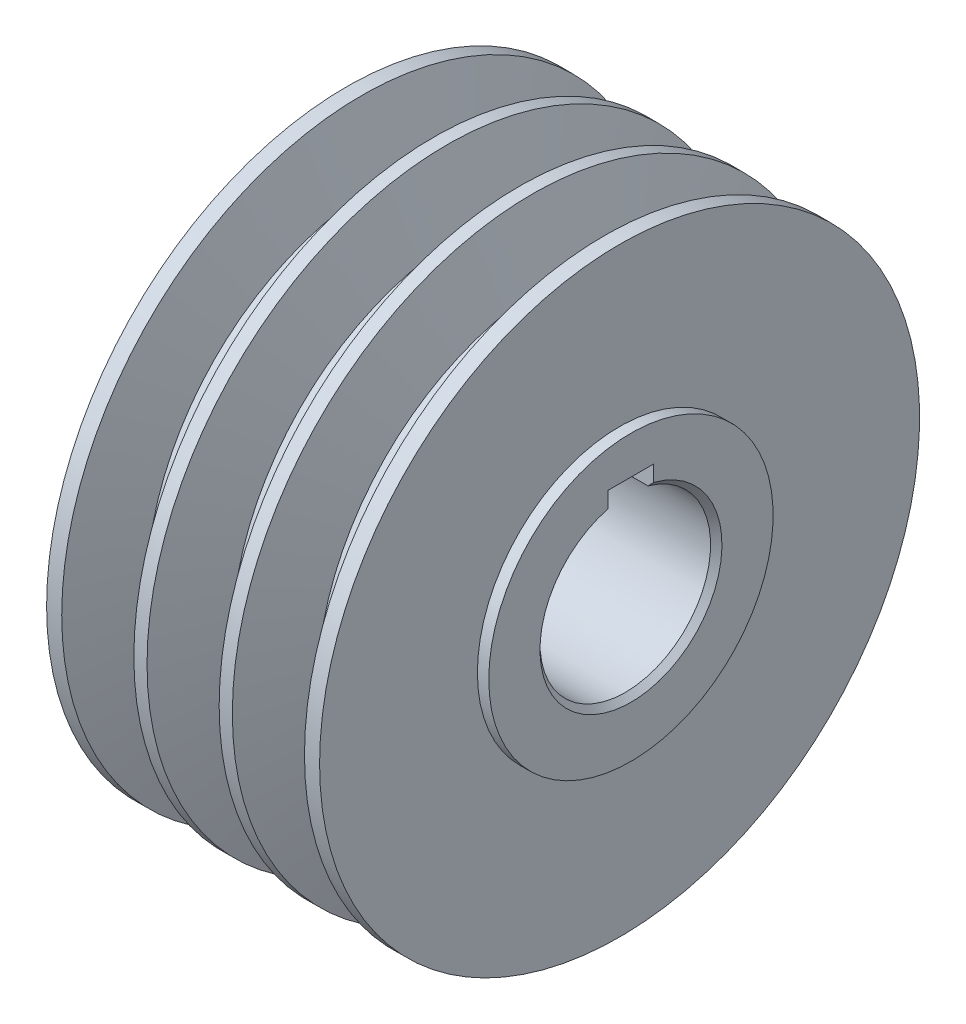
ISO-10303-21;
HEADER;
FILE_DESCRIPTION(('STEP AP214'),'2;1');
FILE_NAME('part.step','',(''),(''),'','','');
FILE_SCHEMA(('AUTOMOTIVE_DESIGN { 1 0 10303 214 1 1 1 1 }'));
ENDSEC;
DATA;
#1=APPLICATION_CONTEXT('core data for automotive mechanical design processes');
#2=APPLICATION_PROTOCOL_DEFINITION('international standard','automotive_design',2000,#1);
#3=PRODUCT_CONTEXT('',#1,'mechanical');
#4=PRODUCT('Part','Part','',(#3));
#5=PRODUCT_RELATED_PRODUCT_CATEGORY('part','',(#4));
#6=PRODUCT_DEFINITION_FORMATION('','',#4);
#7=PRODUCT_DEFINITION_CONTEXT('part definition',#1,'design');
#8=PRODUCT_DEFINITION('design','',#6,#7);
#9=PRODUCT_DEFINITION_SHAPE('','',#8);
#10=(LENGTH_UNIT() NAMED_UNIT(*) SI_UNIT(.MILLI.,.METRE.));
#11=(NAMED_UNIT(*) PLANE_ANGLE_UNIT() SI_UNIT($,.RADIAN.));
#12=(NAMED_UNIT(*) SI_UNIT($,.STERADIAN.) SOLID_ANGLE_UNIT());
#13=UNCERTAINTY_MEASURE_WITH_UNIT(LENGTH_MEASURE(1.E-05),#10,'distance_accuracy_value','');
#14=(GEOMETRIC_REPRESENTATION_CONTEXT(3) GLOBAL_UNCERTAINTY_ASSIGNED_CONTEXT((#13)) GLOBAL_UNIT_ASSIGNED_CONTEXT((#10,
#11,#12)) REPRESENTATION_CONTEXT('',''));
#15=CARTESIAN_POINT('',(0.,0.,0.));
#16=DIRECTION('',(0.,0.,1.));
#17=DIRECTION('',(1.,0.,0.));
#18=AXIS2_PLACEMENT_3D('',#15,#16,#17);
#19=CARTESIAN_POINT('',(0.,0.,0.));
#20=DIRECTION('',(-1.,0.,0.));
#21=DIRECTION('',(0.,0.,1.));
#22=AXIS2_PLACEMENT_3D('',#19,#20,#21);
#23=CYLINDRICAL_SURFACE('',#22,52.75);
#24=CARTESIAN_POINT('',(48.,0.,0.));
#25=DIRECTION('',(-1.,0.,0.));
#26=DIRECTION('',(0.,0.,1.));
#27=AXIS2_PLACEMENT_3D('',#24,#25,#26);
#28=CIRCLE('',#27,52.75);
#29=CARTESIAN_POINT('',(48.,0.,52.75));
#30=VERTEX_POINT('',#29);
#31=EDGE_CURVE('E160',#30,#30,#28,.T.);
#32=ORIENTED_EDGE('',*,*,#31,.T.);
#33=EDGE_LOOP('',(#32));
#34=FACE_BOUND('',#33,.T.);
#35=CARTESIAN_POINT('',(45.3407593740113,0.,0.));
#36=DIRECTION('',(-1.,0.,0.));
#37=DIRECTION('',(0.,0.,1.));
#38=AXIS2_PLACEMENT_3D('',#35,#36,#37);
#39=CIRCLE('',#38,52.75);
#40=CARTESIAN_POINT('',(45.3407593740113,0.,52.75));
#41=VERTEX_POINT('',#40);
#42=EDGE_CURVE('E196',#41,#41,#39,.T.);
#43=ORIENTED_EDGE('',*,*,#42,.F.);
#44=EDGE_LOOP('',(#43));
#45=FACE_BOUND('',#44,.T.);
#46=ADVANCED_FACE('F30',(#34,#45),#23,.T.);
#47=CARTESIAN_POINT('',(30.3407593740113,0.,0.));
#48=DIRECTION('',(-1.,0.,0.));
#49=DIRECTION('',(0.,0.,1.));
#50=AXIS2_PLACEMENT_3D('',#47,#48,#49);
#51=CIRCLE('',#50,52.75);
#52=CARTESIAN_POINT('',(30.3407593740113,0.,52.75));
#53=VERTEX_POINT('',#52);
#54=EDGE_CURVE('E184',#53,#53,#51,.T.);
#55=ORIENTED_EDGE('',*,*,#54,.F.);
#56=EDGE_LOOP('',(#55));
#57=FACE_BOUND('',#56,.T.);
#58=CARTESIAN_POINT('',(32.6592406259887,0.,0.));
#59=DIRECTION('',(-1.,0.,0.));
#60=DIRECTION('',(0.,0.,1.));
#61=AXIS2_PLACEMENT_3D('',#58,#59,#60);
#62=CIRCLE('',#61,52.75);
#63=CARTESIAN_POINT('',(32.6592406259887,0.,52.75));
#64=VERTEX_POINT('',#63);
#65=EDGE_CURVE('E199',#64,#64,#62,.T.);
#66=ORIENTED_EDGE('',*,*,#65,.T.);
#67=EDGE_LOOP('',(#66));
#68=FACE_BOUND('',#67,.T.);
#69=ADVANCED_FACE('F224',(#57,#68),#23,.T.);
#70=CARTESIAN_POINT('',(15.3407593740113,0.,0.));
#71=DIRECTION('',(-1.,0.,0.));
#72=DIRECTION('',(0.,0.,1.));
#73=AXIS2_PLACEMENT_3D('',#70,#71,#72);
#74=CIRCLE('',#73,52.75);
#75=CARTESIAN_POINT('',(15.3407593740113,0.,52.75));
#76=VERTEX_POINT('',#75);
#77=EDGE_CURVE('E172',#76,#76,#74,.T.);
#78=ORIENTED_EDGE('',*,*,#77,.F.);
#79=EDGE_LOOP('',(#78));
#80=FACE_BOUND('',#79,.T.);
#81=CARTESIAN_POINT('',(17.6592406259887,0.,0.));
#82=DIRECTION('',(-1.,0.,0.));
#83=DIRECTION('',(0.,0.,1.));
#84=AXIS2_PLACEMENT_3D('',#81,#82,#83);
#85=CIRCLE('',#84,52.75);
#86=CARTESIAN_POINT('',(17.6592406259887,0.,52.75));
#87=VERTEX_POINT('',#86);
#88=EDGE_CURVE('E187',#87,#87,#85,.T.);
#89=ORIENTED_EDGE('',*,*,#88,.T.);
#90=EDGE_LOOP('',(#89));
#91=FACE_BOUND('',#90,.T.);
#92=ADVANCED_FACE('F231',(#80,#91),#23,.T.);
#93=CARTESIAN_POINT('',(0.,0.,0.));
#94=DIRECTION('',(-1.,0.,0.));
#95=DIRECTION('',(0.,0.,1.));
#96=AXIS2_PLACEMENT_3D('',#93,#94,#95);
#97=CIRCLE('',#96,52.75);
#98=CARTESIAN_POINT('',(0.,0.,52.75));
#99=VERTEX_POINT('',#98);
#100=EDGE_CURVE('E157',#99,#99,#97,.T.);
#101=ORIENTED_EDGE('',*,*,#100,.F.);
#102=EDGE_LOOP('',(#101));
#103=FACE_BOUND('',#102,.T.);
#104=CARTESIAN_POINT('',(2.65924062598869,0.,0.));
#105=DIRECTION('',(-1.,0.,0.));
#106=DIRECTION('',(0.,0.,1.));
#107=AXIS2_PLACEMENT_3D('',#104,#105,#106);
#108=CIRCLE('',#107,52.75);
#109=CARTESIAN_POINT('',(2.65924062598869,0.,52.75));
#110=VERTEX_POINT('',#109);
#111=EDGE_CURVE('E175',#110,#110,#108,.T.);
#112=ORIENTED_EDGE('',*,*,#111,.T.);
#113=EDGE_LOOP('',(#112));
#114=FACE_BOUND('',#113,.T.);
#115=ADVANCED_FACE('F227',(#103,#114),#23,.T.);
#116=CARTESIAN_POINT('',(0.,0.,0.));
#117=DIRECTION('',(-1.,0.,0.));
#118=DIRECTION('',(0.,0.,1.));
#119=AXIS2_PLACEMENT_3D('',#116,#117,#118);
#120=CYLINDRICAL_SURFACE('',#119,15.);
#121=CARTESIAN_POINT('',(1.,0.,0.));
#122=DIRECTION('',(1.,0.,0.));
#123=DIRECTION('',(0.,0.,-1.));
#124=AXIS2_PLACEMENT_3D('',#121,#122,#123);
#125=CIRCLE('',#124,15.);
#126=CARTESIAN_POINT('',(0.999999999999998,14.456832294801,-4.));
#127=VERTEX_POINT('',#126);
#128=CARTESIAN_POINT('',(1.,14.456832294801,3.99999999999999));
#129=VERTEX_POINT('',#128);
#130=EDGE_CURVE('E153',#127,#129,#125,.F.);
#131=ORIENTED_EDGE('',*,*,#130,.T.);
#132=DIRECTION('',(-1.,0.,0.));
#133=VECTOR('',#132,1.);
#134=CARTESIAN_POINT('',(50.,14.456832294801,4.));
#135=LINE('',#134,#133);
#136=CARTESIAN_POINT('',(49.,14.456832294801,4.));
#137=VERTEX_POINT('',#136);
#138=EDGE_CURVE('E50',#137,#129,#135,.T.);
#139=ORIENTED_EDGE('',*,*,#138,.F.);
#140=CARTESIAN_POINT('',(49.,0.,0.));
#141=DIRECTION('',(-1.,0.,0.));
#142=DIRECTION('',(0.,0.,1.));
#143=AXIS2_PLACEMENT_3D('',#140,#141,#142);
#144=CIRCLE('',#143,15.);
#145=CARTESIAN_POINT('',(49.,14.456832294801,-4.));
#146=VERTEX_POINT('',#145);
#147=EDGE_CURVE('E150',#137,#146,#144,.F.);
#148=ORIENTED_EDGE('',*,*,#147,.T.);
#149=DIRECTION('',(-1.,0.,0.));
#150=VECTOR('',#149,1.);
#151=CARTESIAN_POINT('',(50.,14.456832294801,-4.));
#152=LINE('',#151,#150);
#153=EDGE_CURVE('E103',#146,#127,#152,.T.);
#154=ORIENTED_EDGE('',*,*,#153,.T.);
#155=EDGE_LOOP('',(#131,#139,#148,#154));
#156=FACE_BOUND('',#155,.T.);
#157=ADVANCED_FACE('F237',(#156),#120,.F.);
#158=CARTESIAN_POINT('',(0.,15.,0.));
#159=DIRECTION('',(1.,0.,0.));
#160=DIRECTION('',(0.,0.,-1.));
#161=AXIS2_PLACEMENT_3D('',#158,#159,#160);
#162=PLANE('',#161);
#163=CARTESIAN_POINT('',(0.,0.,0.));
#164=DIRECTION('',(1.,0.,0.));
#165=DIRECTION('',(0.,0.,-1.));
#166=AXIS2_PLACEMENT_3D('',#163,#164,#165);
#167=CIRCLE('',#166,16.);
#168=CARTESIAN_POINT('',(0.,15.4919333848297,4.));
#169=VERTEX_POINT('',#168);
#170=CARTESIAN_POINT('',(0.,15.4919333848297,-4.));
#171=VERTEX_POINT('',#170);
#172=EDGE_CURVE('E147',#169,#171,#167,.T.);
#173=ORIENTED_EDGE('',*,*,#172,.T.);
#174=DIRECTION('',(0.,-1.,0.));
#175=VECTOR('',#174,1.);
#176=CARTESIAN_POINT('',(0.,14.456832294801,-4.));
#177=LINE('',#176,#175);
#178=CARTESIAN_POINT('',(0.,18.3,-4.));
#179=VERTEX_POINT('',#178);
#180=EDGE_CURVE('E115',#179,#171,#177,.T.);
#181=ORIENTED_EDGE('',*,*,#180,.F.);
#182=DIRECTION('',(0.,0.,-1.));
#183=VECTOR('',#182,1.);
#184=CARTESIAN_POINT('',(0.,18.3,-4.));
#185=LINE('',#184,#183);
#186=CARTESIAN_POINT('',(0.,18.3,4.));
#187=VERTEX_POINT('',#186);
#188=EDGE_CURVE('E112',#187,#179,#185,.T.);
#189=ORIENTED_EDGE('',*,*,#188,.F.);
#190=DIRECTION('',(0.,1.,0.));
#191=VECTOR('',#190,1.);
#192=CARTESIAN_POINT('',(0.,14.456832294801,4.));
#193=LINE('',#192,#191);
#194=EDGE_CURVE('E93',#169,#187,#193,.T.);
#195=ORIENTED_EDGE('',*,*,#194,.F.);
#196=EDGE_LOOP('',(#173,#181,#189,#195));
#197=FACE_BOUND('',#196,.T.);
#198=ORIENTED_EDGE('',*,*,#100,.T.);
#199=EDGE_LOOP('',(#198));
#200=FACE_BOUND('',#199,.T.);
#201=ADVANCED_FACE('F243',(#197,#200),#162,.F.);
#202=CARTESIAN_POINT('',(48.,52.75,0.));
#203=DIRECTION('',(-1.,0.,0.));
#204=DIRECTION('',(0.,0.,1.));
#205=AXIS2_PLACEMENT_3D('',#202,#203,#204);
#206=PLANE('',#205);
#207=ORIENTED_EDGE('',*,*,#31,.F.);
#208=EDGE_LOOP('',(#207));
#209=FACE_BOUND('',#208,.T.);
#210=CARTESIAN_POINT('',(48.,0.,0.));
#211=DIRECTION('',(-1.,0.,0.));
#212=DIRECTION('',(0.,0.,1.));
#213=AXIS2_PLACEMENT_3D('',#210,#211,#212);
#214=CIRCLE('',#213,25.);
#215=CARTESIAN_POINT('',(48.,0.,25.));
#216=VERTEX_POINT('',#215);
#217=EDGE_CURVE('E163',#216,#216,#214,.T.);
#218=ORIENTED_EDGE('',*,*,#217,.T.);
#219=EDGE_LOOP('',(#218));
#220=FACE_BOUND('',#219,.T.);
#221=ADVANCED_FACE('F274',(#209,#220),#206,.F.);
#222=CARTESIAN_POINT('',(0.,0.,0.));
#223=DIRECTION('',(-1.,0.,0.));
#224=DIRECTION('',(0.,0.,1.));
#225=AXIS2_PLACEMENT_3D('',#222,#223,#224);
#226=CYLINDRICAL_SURFACE('',#225,25.);
#227=ORIENTED_EDGE('',*,*,#217,.F.);
#228=EDGE_LOOP('',(#227));
#229=FACE_BOUND('',#228,.T.);
#230=CARTESIAN_POINT('',(50.,0.,0.));
#231=DIRECTION('',(-1.,0.,0.));
#232=DIRECTION('',(0.,0.,1.));
#233=AXIS2_PLACEMENT_3D('',#230,#231,#232);
#234=CIRCLE('',#233,25.);
#235=CARTESIAN_POINT('',(50.,0.,25.));
#236=VERTEX_POINT('',#235);
#237=EDGE_CURVE('E166',#236,#236,#234,.T.);
#238=ORIENTED_EDGE('',*,*,#237,.T.);
#239=EDGE_LOOP('',(#238));
#240=FACE_BOUND('',#239,.T.);
#241=ADVANCED_FACE('F272',(#229,#240),#226,.T.);
#242=CARTESIAN_POINT('',(50.,25.,0.));
#243=DIRECTION('',(-1.,0.,0.));
#244=DIRECTION('',(0.,0.,1.));
#245=AXIS2_PLACEMENT_3D('',#242,#243,#244);
#246=PLANE('',#245);
#247=DIRECTION('',(0.,0.,-1.));
#248=VECTOR('',#247,1.);
#249=CARTESIAN_POINT('',(50.,18.3,-4.));
#250=LINE('',#249,#248);
#251=CARTESIAN_POINT('',(50.,18.3,4.));
#252=VERTEX_POINT('',#251);
#253=CARTESIAN_POINT('',(50.,18.3,-4.));
#254=VERTEX_POINT('',#253);
#255=EDGE_CURVE('E100',#252,#254,#250,.T.);
#256=ORIENTED_EDGE('',*,*,#255,.T.);
#257=DIRECTION('',(0.,-1.,0.));
#258=VECTOR('',#257,1.);
#259=CARTESIAN_POINT('',(50.,14.456832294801,-4.));
#260=LINE('',#259,#258);
#261=CARTESIAN_POINT('',(50.,15.4919333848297,-4.));
#262=VERTEX_POINT('',#261);
#263=EDGE_CURVE('E110',#254,#262,#260,.T.);
#264=ORIENTED_EDGE('',*,*,#263,.T.);
#265=CARTESIAN_POINT('',(50.,0.,0.));
#266=DIRECTION('',(-1.,0.,0.));
#267=DIRECTION('',(0.,0.,1.));
#268=AXIS2_PLACEMENT_3D('',#265,#266,#267);
#269=CIRCLE('',#268,16.);
#270=CARTESIAN_POINT('',(50.,15.4919333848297,4.));
#271=VERTEX_POINT('',#270);
#272=EDGE_CURVE('E109',#262,#271,#269,.T.);
#273=ORIENTED_EDGE('',*,*,#272,.T.);
#274=DIRECTION('',(0.,1.,0.));
#275=VECTOR('',#274,1.);
#276=CARTESIAN_POINT('',(50.,14.456832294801,4.));
#277=LINE('',#276,#275);
#278=EDGE_CURVE('E90',#271,#252,#277,.T.);
#279=ORIENTED_EDGE('',*,*,#278,.T.);
#280=EDGE_LOOP('',(#256,#264,#273,#279));
#281=FACE_BOUND('',#280,.T.);
#282=ORIENTED_EDGE('',*,*,#237,.F.);
#283=EDGE_LOOP('',(#282));
#284=FACE_BOUND('',#283,.T.);
#285=ADVANCED_FACE('F106',(#281,#284),#246,.F.);
#286=CARTESIAN_POINT('',(0.,0.,0.));
#287=DIRECTION('',(-1.,0.,0.));
#288=DIRECTION('',(0.,0.,1.));
#289=AXIS2_PLACEMENT_3D('',#286,#287,#288);
#290=CYLINDRICAL_SURFACE('',#289,41.3);
#291=CARTESIAN_POINT('',(11.8401430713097,0.,0.));
#292=DIRECTION('',(-1.,0.,0.));
#293=DIRECTION('',(0.,0.,1.));
#294=AXIS2_PLACEMENT_3D('',#291,#292,#293);
#295=CIRCLE('',#294,41.3);
#296=CARTESIAN_POINT('',(11.8401430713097,0.,41.3));
#297=VERTEX_POINT('',#296);
#298=EDGE_CURVE('E169',#297,#297,#295,.T.);
#299=ORIENTED_EDGE('',*,*,#298,.T.);
#300=EDGE_LOOP('',(#299));
#301=FACE_BOUND('',#300,.T.);
#302=CARTESIAN_POINT('',(6.15985692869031,0.,0.));
#303=DIRECTION('',(-1.,0.,0.));
#304=DIRECTION('',(0.,0.,1.));
#305=AXIS2_PLACEMENT_3D('',#302,#303,#304);
#306=CIRCLE('',#305,41.3);
#307=CARTESIAN_POINT('',(6.15985692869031,0.,41.3));
#308=VERTEX_POINT('',#307);
#309=EDGE_CURVE('E178',#308,#308,#306,.T.);
#310=ORIENTED_EDGE('',*,*,#309,.F.);
#311=EDGE_LOOP('',(#310));
#312=FACE_BOUND('',#311,.T.);
#313=ADVANCED_FACE('F262',(#301,#312),#290,.T.);
#314=CARTESIAN_POINT('',(11.8401430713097,0.,0.));
#315=DIRECTION('',(1.,0.,0.));
#316=DIRECTION('',(0.,0.,-1.));
#317=AXIS2_PLACEMENT_3D('',#314,#315,#316);
#318=CONICAL_SURFACE('',#317,41.3,1.27409035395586);
#319=ORIENTED_EDGE('',*,*,#77,.T.);
#320=EDGE_LOOP('',(#319));
#321=FACE_BOUND('',#320,.T.);
#322=ORIENTED_EDGE('',*,*,#298,.F.);
#323=EDGE_LOOP('',(#322));
#324=FACE_BOUND('',#323,.T.);
#325=ADVANCED_FACE('F253',(#321,#324),#318,.T.);
#326=CARTESIAN_POINT('',(2.65924062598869,0.,0.));
#327=DIRECTION('',(-1.,0.,0.));
#328=DIRECTION('',(0.,0.,1.));
#329=AXIS2_PLACEMENT_3D('',#326,#327,#328);
#330=CONICAL_SURFACE('',#329,52.75,1.27409035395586);
#331=ORIENTED_EDGE('',*,*,#309,.T.);
#332=EDGE_LOOP('',(#331));
#333=FACE_BOUND('',#332,.T.);
#334=ORIENTED_EDGE('',*,*,#111,.F.);
#335=EDGE_LOOP('',(#334));
#336=FACE_BOUND('',#335,.T.);
#337=ADVANCED_FACE('F250',(#333,#336),#330,.T.);
#338=CARTESIAN_POINT('',(15.,0.,0.));
#339=DIRECTION('',(-1.,0.,0.));
#340=DIRECTION('',(0.,0.,1.));
#341=AXIS2_PLACEMENT_3D('',#338,#339,#340);
#342=CYLINDRICAL_SURFACE('',#341,41.3);
#343=CARTESIAN_POINT('',(26.8401430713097,0.,0.));
#344=DIRECTION('',(-1.,0.,0.));
#345=DIRECTION('',(0.,0.,1.));
#346=AXIS2_PLACEMENT_3D('',#343,#344,#345);
#347=CIRCLE('',#346,41.3);
#348=CARTESIAN_POINT('',(26.8401430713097,0.,41.3));
#349=VERTEX_POINT('',#348);
#350=EDGE_CURVE('E181',#349,#349,#347,.T.);
#351=ORIENTED_EDGE('',*,*,#350,.T.);
#352=EDGE_LOOP('',(#351));
#353=FACE_BOUND('',#352,.T.);
#354=CARTESIAN_POINT('',(21.1598569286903,0.,0.));
#355=DIRECTION('',(-1.,0.,0.));
#356=DIRECTION('',(0.,0.,1.));
#357=AXIS2_PLACEMENT_3D('',#354,#355,#356);
#358=CIRCLE('',#357,41.3);
#359=CARTESIAN_POINT('',(21.1598569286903,0.,41.3));
#360=VERTEX_POINT('',#359);
#361=EDGE_CURVE('E190',#360,#360,#358,.T.);
#362=ORIENTED_EDGE('',*,*,#361,.F.);
#363=EDGE_LOOP('',(#362));
#364=FACE_BOUND('',#363,.T.);
#365=ADVANCED_FACE('F252',(#353,#364),#342,.T.);
#366=CARTESIAN_POINT('',(26.8401430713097,0.,0.));
#367=DIRECTION('',(1.,0.,0.));
#368=DIRECTION('',(0.,0.,-1.));
#369=AXIS2_PLACEMENT_3D('',#366,#367,#368);
#370=CONICAL_SURFACE('',#369,41.3,1.27409035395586);
#371=ORIENTED_EDGE('',*,*,#54,.T.);
#372=EDGE_LOOP('',(#371));
#373=FACE_BOUND('',#372,.T.);
#374=ORIENTED_EDGE('',*,*,#350,.F.);
#375=EDGE_LOOP('',(#374));
#376=FACE_BOUND('',#375,.T.);
#377=ADVANCED_FACE('F220',(#373,#376),#370,.T.);
#378=CARTESIAN_POINT('',(17.6592406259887,0.,0.));
#379=DIRECTION('',(-1.,0.,0.));
#380=DIRECTION('',(0.,0.,1.));
#381=AXIS2_PLACEMENT_3D('',#378,#379,#380);
#382=CONICAL_SURFACE('',#381,52.75,1.27409035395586);
#383=ORIENTED_EDGE('',*,*,#361,.T.);
#384=EDGE_LOOP('',(#383));
#385=FACE_BOUND('',#384,.T.);
#386=ORIENTED_EDGE('',*,*,#88,.F.);
#387=EDGE_LOOP('',(#386));
#388=FACE_BOUND('',#387,.T.);
#389=ADVANCED_FACE('F211',(#385,#388),#382,.T.);
#390=CARTESIAN_POINT('',(30.,0.,0.));
#391=DIRECTION('',(-1.,0.,0.));
#392=DIRECTION('',(0.,0.,1.));
#393=AXIS2_PLACEMENT_3D('',#390,#391,#392);
#394=CYLINDRICAL_SURFACE('',#393,41.3);
#395=CARTESIAN_POINT('',(41.8401430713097,0.,0.));
#396=DIRECTION('',(-1.,0.,0.));
#397=DIRECTION('',(0.,0.,1.));
#398=AXIS2_PLACEMENT_3D('',#395,#396,#397);
#399=CIRCLE('',#398,41.3);
#400=CARTESIAN_POINT('',(41.8401430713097,0.,41.3));
#401=VERTEX_POINT('',#400);
#402=EDGE_CURVE('E193',#401,#401,#399,.T.);
#403=ORIENTED_EDGE('',*,*,#402,.T.);
#404=EDGE_LOOP('',(#403));
#405=FACE_BOUND('',#404,.T.);
#406=CARTESIAN_POINT('',(36.1598569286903,0.,0.));
#407=DIRECTION('',(-1.,0.,0.));
#408=DIRECTION('',(0.,0.,1.));
#409=AXIS2_PLACEMENT_3D('',#406,#407,#408);
#410=CIRCLE('',#409,41.3);
#411=CARTESIAN_POINT('',(36.1598569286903,0.,41.3));
#412=VERTEX_POINT('',#411);
#413=EDGE_CURVE('E201',#412,#412,#410,.T.);
#414=ORIENTED_EDGE('',*,*,#413,.F.);
#415=EDGE_LOOP('',(#414));
#416=FACE_BOUND('',#415,.T.);
#417=ADVANCED_FACE('F208',(#405,#416),#394,.T.);
#418=CARTESIAN_POINT('',(41.8401430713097,0.,0.));
#419=DIRECTION('',(1.,0.,0.));
#420=DIRECTION('',(0.,0.,-1.));
#421=AXIS2_PLACEMENT_3D('',#418,#419,#420);
#422=CONICAL_SURFACE('',#421,41.3,1.27409035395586);
#423=ORIENTED_EDGE('',*,*,#42,.T.);
#424=EDGE_LOOP('',(#423));
#425=FACE_BOUND('',#424,.T.);
#426=ORIENTED_EDGE('',*,*,#402,.F.);
#427=EDGE_LOOP('',(#426));
#428=FACE_BOUND('',#427,.T.);
#429=ADVANCED_FACE('F210',(#425,#428),#422,.T.);
#430=CARTESIAN_POINT('',(32.6592406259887,0.,0.));
#431=DIRECTION('',(-1.,0.,0.));
#432=DIRECTION('',(0.,0.,1.));
#433=AXIS2_PLACEMENT_3D('',#430,#431,#432);
#434=CONICAL_SURFACE('',#433,52.75,1.27409035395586);
#435=ORIENTED_EDGE('',*,*,#413,.T.);
#436=EDGE_LOOP('',(#435));
#437=FACE_BOUND('',#436,.T.);
#438=ORIENTED_EDGE('',*,*,#65,.F.);
#439=EDGE_LOOP('',(#438));
#440=FACE_BOUND('',#439,.T.);
#441=ADVANCED_FACE('F205',(#437,#440),#434,.T.);
#442=CARTESIAN_POINT('',(50.,0.,0.));
#443=DIRECTION('',(1.,0.,0.));
#444=DIRECTION('',(0.,0.,-1.));
#445=AXIS2_PLACEMENT_3D('',#442,#443,#444);
#446=CONICAL_SURFACE('',#445,16.,0.785398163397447);
#447=CARTESIAN_POINT('',(46.7508627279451,12.1072086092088,-4.));
#448=CARTESIAN_POINT('',(47.1600195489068,12.5380559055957,-4.));
#449=CARTESIAN_POINT('',(47.5702411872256,12.9678883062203,-4.));
#450=CARTESIAN_POINT('',(48.3923802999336,13.8259206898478,-4.));
#451=CARTESIAN_POINT('',(48.8042977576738,14.254120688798,-4.));
#452=CARTESIAN_POINT('',(49.6294009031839,15.1092921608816,-4.));
#453=CARTESIAN_POINT('',(50.0425865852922,15.5362636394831,-4.));
#454=CARTESIAN_POINT('',(50.8699775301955,16.3892258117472,-4.));
#455=CARTESIAN_POINT('',(51.2841828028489,16.8152164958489,-4.));
#456=CARTESIAN_POINT('',(51.6987686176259,17.2408355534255,-4.));
#457=B_SPLINE_CURVE_WITH_KNOTS('',3,(#447,#448,#449,#450,#451,#452,#453,#454,#455,#456),
.UNSPECIFIED.,.F.,.F.,(4,2,2,2,4),(0.,1.78250615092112,3.56499484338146,5.34747558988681,
7.12997363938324),.UNSPECIFIED.);
#458=EDGE_CURVE('E58',#146,#262,#457,.T.);
#459=ORIENTED_EDGE('',*,*,#458,.F.);
#460=ORIENTED_EDGE('',*,*,#147,.F.);
#461=CARTESIAN_POINT('',(51.6987686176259,17.2408355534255,4.));
#462=CARTESIAN_POINT('',(51.2841828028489,16.8152164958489,4.));
#463=CARTESIAN_POINT('',(50.8699775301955,16.3892258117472,4.));
#464=CARTESIAN_POINT('',(50.0425865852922,15.5362636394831,4.));
#465=CARTESIAN_POINT('',(49.6294009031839,15.1092921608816,4.));
#466=CARTESIAN_POINT('',(48.8042977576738,14.254120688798,4.));
#467=CARTESIAN_POINT('',(48.3923802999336,13.8259206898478,4.));
#468=CARTESIAN_POINT('',(47.5702411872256,12.9678883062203,4.));
#469=CARTESIAN_POINT('',(47.1600195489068,12.5380559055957,4.));
#470=CARTESIAN_POINT('',(46.7508627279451,12.1072086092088,4.));
#471=B_SPLINE_CURVE_WITH_KNOTS('',3,(#461,#462,#463,#464,#465,#466,#467,#468,#469,#470),
.UNSPECIFIED.,.F.,.F.,(4,2,2,2,4),(0.,1.78249804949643,3.56497879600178,5.34746748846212,
7.12997363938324),.UNSPECIFIED.);
#472=EDGE_CURVE('E119',#271,#137,#471,.T.);
#473=ORIENTED_EDGE('',*,*,#472,.F.);
#474=ORIENTED_EDGE('',*,*,#272,.F.);
#475=EDGE_LOOP('',(#459,#460,#473,#474));
#476=FACE_BOUND('',#475,.T.);
#477=ADVANCED_FACE('F133',(#476),#446,.F.);
#478=CARTESIAN_POINT('',(1.,0.,0.));
#479=DIRECTION('',(-1.,0.,0.));
#480=DIRECTION('',(0.,0.,1.));
#481=AXIS2_PLACEMENT_3D('',#478,#479,#480);
#482=CONICAL_SURFACE('',#481,15.,0.78539816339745);
#483=CARTESIAN_POINT('',(-2.13496667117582,17.6883299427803,-4.));
#484=CARTESIAN_POINT('',(-1.72010842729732,17.2629775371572,-4.));
#485=CARTESIAN_POINT('',(-1.30560413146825,16.8372791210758,-4.));
#486=CARTESIAN_POINT('',(-0.477534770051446,15.9849766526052,-4.));
#487=CARTESIAN_POINT('',(-0.0639696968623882,15.5583726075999,-4.));
#488=CARTESIAN_POINT('',(0.761998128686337,14.7040368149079,-4.));
#489=CARTESIAN_POINT('',(1.17440087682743,14.2763050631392,-4.));
#490=CARTESIAN_POINT('',(1.99766707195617,13.4193564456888,-4.));
#491=CARTESIAN_POINT('',(2.40853050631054,12.9901395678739,-4.));
#492=CARTESIAN_POINT('',(2.81843316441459,12.5600041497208,-4.));
#493=B_SPLINE_CURVE_WITH_KNOTS('',3,(#483,#484,#485,#486,#487,#488,#489,#490,#491,#492),
.UNSPECIFIED.,.F.,.F.,(4,2,2,2,4),(0.,1.78249553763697,3.56497659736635,5.34746411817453,
7.12996623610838),.UNSPECIFIED.);
#494=EDGE_CURVE('E11',#171,#127,#493,.T.);
#495=ORIENTED_EDGE('',*,*,#494,.F.);
#496=ORIENTED_EDGE('',*,*,#172,.F.);
#497=CARTESIAN_POINT('',(2.81843316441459,12.5600041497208,4.));
#498=CARTESIAN_POINT('',(2.40853050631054,12.9901395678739,4.));
#499=CARTESIAN_POINT('',(1.99766707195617,13.4193564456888,4.));
#500=CARTESIAN_POINT('',(1.17440087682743,14.2763050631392,4.));
#501=CARTESIAN_POINT('',(0.761998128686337,14.7040368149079,4.));
#502=CARTESIAN_POINT('',(-0.0639696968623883,15.5583726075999,4.));
#503=CARTESIAN_POINT('',(-0.477534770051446,15.9849766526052,4.));
#504=CARTESIAN_POINT('',(-1.30560413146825,16.8372791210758,4.));
#505=CARTESIAN_POINT('',(-1.72010842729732,17.2629775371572,4.));
#506=CARTESIAN_POINT('',(-2.13496667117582,17.6883299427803,4.));
#507=B_SPLINE_CURVE_WITH_KNOTS('',3,(#497,#498,#499,#500,#501,#502,#503,#504,#505,#506),
.UNSPECIFIED.,.F.,.F.,(4,2,2,2,4),(0.,1.78250211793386,3.56498963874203,5.34747069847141,
7.12996623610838),.UNSPECIFIED.);
#508=EDGE_CURVE('E43',#129,#169,#507,.T.);
#509=ORIENTED_EDGE('',*,*,#508,.F.);
#510=ORIENTED_EDGE('',*,*,#130,.F.);
#511=EDGE_LOOP('',(#495,#496,#509,#510));
#512=FACE_BOUND('',#511,.T.);
#513=ADVANCED_FACE('F32',(#512),#482,.F.);
#514=CARTESIAN_POINT('',(50.,14.456832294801,-4.));
#515=DIRECTION('',(0.,0.,-1.));
#516=DIRECTION('',(-1.,0.,0.));
#517=AXIS2_PLACEMENT_3D('',#514,#515,#516);
#518=PLANE('',#517);
#519=ORIENTED_EDGE('',*,*,#458,.T.);
#520=ORIENTED_EDGE('',*,*,#263,.F.);
#521=DIRECTION('',(-1.,0.,0.));
#522=VECTOR('',#521,1.);
#523=CARTESIAN_POINT('',(50.,18.3,-4.));
#524=LINE('',#523,#522);
#525=EDGE_CURVE('E97',#254,#179,#524,.T.);
#526=ORIENTED_EDGE('',*,*,#525,.T.);
#527=ORIENTED_EDGE('',*,*,#180,.T.);
#528=ORIENTED_EDGE('',*,*,#494,.T.);
#529=ORIENTED_EDGE('',*,*,#153,.F.);
#530=EDGE_LOOP('',(#519,#520,#526,#527,#528,#529));
#531=FACE_BOUND('',#530,.T.);
#532=ADVANCED_FACE('F139',(#531),#518,.F.);
#533=CARTESIAN_POINT('',(50.,18.3,-4.));
#534=DIRECTION('',(0.,1.,0.));
#535=DIRECTION('',(0.,0.,1.));
#536=AXIS2_PLACEMENT_3D('',#533,#534,#535);
#537=PLANE('',#536);
#538=ORIENTED_EDGE('',*,*,#188,.T.);
#539=ORIENTED_EDGE('',*,*,#525,.F.);
#540=ORIENTED_EDGE('',*,*,#255,.F.);
#541=DIRECTION('',(-1.,0.,0.));
#542=VECTOR('',#541,1.);
#543=CARTESIAN_POINT('',(50.,18.3,4.));
#544=LINE('',#543,#542);
#545=EDGE_CURVE('E86',#252,#187,#544,.T.);
#546=ORIENTED_EDGE('',*,*,#545,.T.);
#547=EDGE_LOOP('',(#538,#539,#540,#546));
#548=FACE_BOUND('',#547,.T.);
#549=ADVANCED_FACE('F101',(#548),#537,.F.);
#550=CARTESIAN_POINT('',(50.,14.456832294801,4.));
#551=DIRECTION('',(0.,0.,1.));
#552=DIRECTION('',(1.,0.,0.));
#553=AXIS2_PLACEMENT_3D('',#550,#551,#552);
#554=PLANE('',#553);
#555=ORIENTED_EDGE('',*,*,#472,.T.);
#556=ORIENTED_EDGE('',*,*,#138,.T.);
#557=ORIENTED_EDGE('',*,*,#508,.T.);
#558=ORIENTED_EDGE('',*,*,#194,.T.);
#559=ORIENTED_EDGE('',*,*,#545,.F.);
#560=ORIENTED_EDGE('',*,*,#278,.F.);
#561=EDGE_LOOP('',(#555,#556,#557,#558,#559,#560));
#562=FACE_BOUND('',#561,.T.);
#563=ADVANCED_FACE('F88',(#562),#554,.F.);
#564=CLOSED_SHELL('',(#46,#69,#92,#115,#157,#201,#221,#241,#285,#313,#325,#337,#365,#377,#389,
#417,#429,#441,#477,#513,#532,#549,#563));
#565=MANIFOLD_SOLID_BREP('B2',#564);
#566=ADVANCED_BREP_SHAPE_REPRESENTATION('',(#18,#565),#14);
#567=SHAPE_DEFINITION_REPRESENTATION(#9,#566);
ENDSEC;
END-ISO-10303-21;
